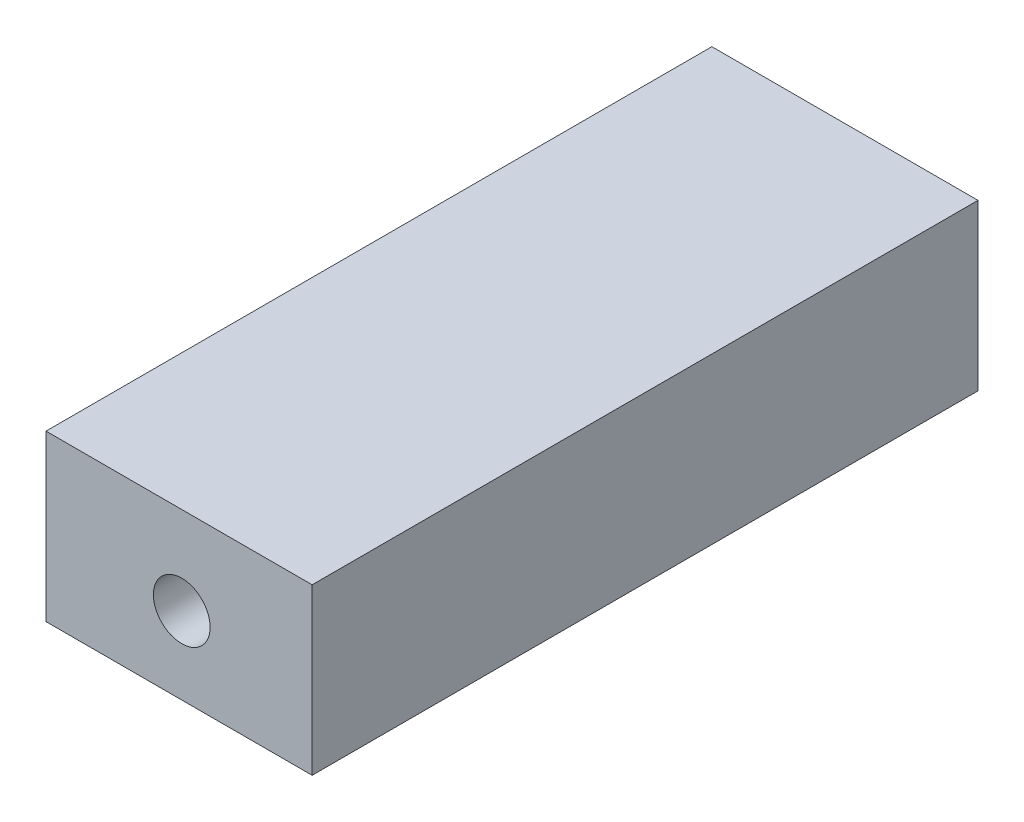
ISO-10303-21;
HEADER;
FILE_DESCRIPTION(('STEP AP214'),'2;1');
FILE_NAME('part.step','',(''),(''),'','','');
FILE_SCHEMA(('AUTOMOTIVE_DESIGN { 1 0 10303 214 1 1 1 1 }'));
ENDSEC;
DATA;
#1=APPLICATION_CONTEXT('core data for automotive mechanical design processes');
#2=APPLICATION_PROTOCOL_DEFINITION('international standard','automotive_design',2000,#1);
#3=PRODUCT_CONTEXT('',#1,'mechanical');
#4=PRODUCT('Part','Part','',(#3));
#5=PRODUCT_RELATED_PRODUCT_CATEGORY('part','',(#4));
#6=PRODUCT_DEFINITION_FORMATION('','',#4);
#7=PRODUCT_DEFINITION_CONTEXT('part definition',#1,'design');
#8=PRODUCT_DEFINITION('design','',#6,#7);
#9=PRODUCT_DEFINITION_SHAPE('','',#8);
#10=(LENGTH_UNIT() NAMED_UNIT(*) SI_UNIT(.MILLI.,.METRE.));
#11=(NAMED_UNIT(*) PLANE_ANGLE_UNIT() SI_UNIT($,.RADIAN.));
#12=(NAMED_UNIT(*) SI_UNIT($,.STERADIAN.) SOLID_ANGLE_UNIT());
#13=UNCERTAINTY_MEASURE_WITH_UNIT(LENGTH_MEASURE(1.E-05),#10,'distance_accuracy_value','');
#14=(GEOMETRIC_REPRESENTATION_CONTEXT(3) GLOBAL_UNCERTAINTY_ASSIGNED_CONTEXT((#13)) GLOBAL_UNIT_ASSIGNED_CONTEXT((#10,
#11,#12)) REPRESENTATION_CONTEXT('',''));
#15=CARTESIAN_POINT('',(0.,0.,0.));
#16=DIRECTION('',(0.,0.,1.));
#17=DIRECTION('',(1.,0.,0.));
#18=AXIS2_PLACEMENT_3D('',#15,#16,#17);
#19=CARTESIAN_POINT('',(0.,0.,31.75));
#20=DIRECTION('',(1.,0.,0.));
#21=DIRECTION('',(0.,0.,-1.));
#22=AXIS2_PLACEMENT_3D('',#19,#20,#21);
#23=PLANE('',#22);
#24=DIRECTION('',(0.,-1.,0.));
#25=VECTOR('',#24,1.);
#26=CARTESIAN_POINT('',(0.,0.,0.));
#27=LINE('',#26,#25);
#28=CARTESIAN_POINT('',(0.,7.86813937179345,0.));
#29=VERTEX_POINT('',#28);
#30=CARTESIAN_POINT('',(0.,0.,0.));
#31=VERTEX_POINT('',#30);
#32=EDGE_CURVE('E93',#29,#31,#27,.T.);
#33=ORIENTED_EDGE('',*,*,#32,.T.);
#34=DIRECTION('',(0.,0.,-1.));
#35=VECTOR('',#34,1.);
#36=CARTESIAN_POINT('',(0.,0.,31.75));
#37=LINE('',#36,#35);
#38=CARTESIAN_POINT('',(0.,0.,31.75));
#39=VERTEX_POINT('',#38);
#40=EDGE_CURVE('E11',#39,#31,#37,.T.);
#41=ORIENTED_EDGE('',*,*,#40,.F.);
#42=DIRECTION('',(0.,-1.,0.));
#43=VECTOR('',#42,1.);
#44=CARTESIAN_POINT('',(0.,0.,31.75));
#45=LINE('',#44,#43);
#46=CARTESIAN_POINT('',(0.,7.86813937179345,31.75));
#47=VERTEX_POINT('',#46);
#48=EDGE_CURVE('E96',#47,#39,#45,.T.);
#49=ORIENTED_EDGE('',*,*,#48,.F.);
#50=DIRECTION('',(0.,0.,-1.));
#51=VECTOR('',#50,1.);
#52=CARTESIAN_POINT('',(0.,7.86813937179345,31.75));
#53=LINE('',#52,#51);
#54=EDGE_CURVE('E102',#47,#29,#53,.T.);
#55=ORIENTED_EDGE('',*,*,#54,.T.);
#56=EDGE_LOOP('',(#33,#41,#49,#55));
#57=FACE_BOUND('',#56,.T.);
#58=ADVANCED_FACE('F30',(#57),#23,.F.);
#59=CARTESIAN_POINT('',(0.,0.,31.75));
#60=DIRECTION('',(0.,1.,0.));
#61=DIRECTION('',(0.,0.,1.));
#62=AXIS2_PLACEMENT_3D('',#59,#60,#61);
#63=PLANE('',#62);
#64=DIRECTION('',(1.,0.,0.));
#65=VECTOR('',#64,1.);
#66=CARTESIAN_POINT('',(0.,0.,0.));
#67=LINE('',#66,#65);
#68=CARTESIAN_POINT('',(12.6905473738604,0.,0.));
#69=VERTEX_POINT('',#68);
#70=EDGE_CURVE('E105',#31,#69,#67,.T.);
#71=ORIENTED_EDGE('',*,*,#70,.T.);
#72=DIRECTION('',(0.,0.,-1.));
#73=VECTOR('',#72,1.);
#74=CARTESIAN_POINT('',(12.6905473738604,0.,31.75));
#75=LINE('',#74,#73);
#76=CARTESIAN_POINT('',(12.6905473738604,0.,31.75));
#77=VERTEX_POINT('',#76);
#78=EDGE_CURVE('E38',#77,#69,#75,.T.);
#79=ORIENTED_EDGE('',*,*,#78,.F.);
#80=DIRECTION('',(1.,0.,0.));
#81=VECTOR('',#80,1.);
#82=CARTESIAN_POINT('',(0.,0.,31.75));
#83=LINE('',#82,#81);
#84=EDGE_CURVE('E77',#39,#77,#83,.T.);
#85=ORIENTED_EDGE('',*,*,#84,.F.);
#86=ORIENTED_EDGE('',*,*,#40,.T.);
#87=EDGE_LOOP('',(#71,#79,#85,#86));
#88=FACE_BOUND('',#87,.T.);
#89=ADVANCED_FACE('F129',(#88),#63,.F.);
#90=CARTESIAN_POINT('',(12.6905473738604,0.,31.75));
#91=DIRECTION('',(-1.,0.,0.));
#92=DIRECTION('',(0.,0.,1.));
#93=AXIS2_PLACEMENT_3D('',#90,#91,#92);
#94=PLANE('',#93);
#95=DIRECTION('',(0.,1.,0.));
#96=VECTOR('',#95,1.);
#97=CARTESIAN_POINT('',(12.6905473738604,0.,0.));
#98=LINE('',#97,#96);
#99=CARTESIAN_POINT('',(12.6905473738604,7.86813937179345,0.));
#100=VERTEX_POINT('',#99);
#101=EDGE_CURVE('E64',#69,#100,#98,.T.);
#102=ORIENTED_EDGE('',*,*,#101,.T.);
#103=DIRECTION('',(0.,0.,-1.));
#104=VECTOR('',#103,1.);
#105=CARTESIAN_POINT('',(12.6905473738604,7.86813937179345,31.75));
#106=LINE('',#105,#104);
#107=CARTESIAN_POINT('',(12.6905473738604,7.86813937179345,31.75));
#108=VERTEX_POINT('',#107);
#109=EDGE_CURVE('E110',#108,#100,#106,.T.);
#110=ORIENTED_EDGE('',*,*,#109,.F.);
#111=DIRECTION('',(0.,1.,0.));
#112=VECTOR('',#111,1.);
#113=CARTESIAN_POINT('',(12.6905473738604,0.,31.75));
#114=LINE('',#113,#112);
#115=EDGE_CURVE('E99',#77,#108,#114,.T.);
#116=ORIENTED_EDGE('',*,*,#115,.F.);
#117=ORIENTED_EDGE('',*,*,#78,.T.);
#118=EDGE_LOOP('',(#102,#110,#116,#117));
#119=FACE_BOUND('',#118,.T.);
#120=ADVANCED_FACE('F112',(#119),#94,.F.);
#121=CARTESIAN_POINT('',(0.,7.86813937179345,31.75));
#122=DIRECTION('',(0.,-1.,0.));
#123=DIRECTION('',(0.,0.,-1.));
#124=AXIS2_PLACEMENT_3D('',#121,#122,#123);
#125=PLANE('',#124);
#126=DIRECTION('',(-1.,0.,0.));
#127=VECTOR('',#126,1.);
#128=CARTESIAN_POINT('',(0.,7.86813937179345,0.));
#129=LINE('',#128,#127);
#130=EDGE_CURVE('E70',#100,#29,#129,.T.);
#131=ORIENTED_EDGE('',*,*,#130,.T.);
#132=ORIENTED_EDGE('',*,*,#54,.F.);
#133=DIRECTION('',(-1.,0.,0.));
#134=VECTOR('',#133,1.);
#135=CARTESIAN_POINT('',(0.,7.86813937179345,31.75));
#136=LINE('',#135,#134);
#137=EDGE_CURVE('E46',#108,#47,#136,.T.);
#138=ORIENTED_EDGE('',*,*,#137,.F.);
#139=ORIENTED_EDGE('',*,*,#109,.T.);
#140=EDGE_LOOP('',(#131,#132,#138,#139));
#141=FACE_BOUND('',#140,.T.);
#142=ADVANCED_FACE('F119',(#141),#125,.F.);
#143=CARTESIAN_POINT('',(0.,7.86813937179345,31.75));
#144=DIRECTION('',(0.,0.,-1.));
#145=DIRECTION('',(-1.,0.,0.));
#146=AXIS2_PLACEMENT_3D('',#143,#144,#145);
#147=PLANE('',#146);
#148=CARTESIAN_POINT('',(6.47306078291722,3.67982369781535,31.75));
#149=DIRECTION('',(0.,0.,1.));
#150=DIRECTION('',(1.,0.,0.));
#151=AXIS2_PLACEMENT_3D('',#148,#149,#150);
#152=CIRCLE('',#151,1.35255);
#153=CARTESIAN_POINT('',(7.82561078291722,3.67982369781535,31.75));
#154=VERTEX_POINT('',#153);
#155=EDGE_CURVE('E90',#154,#154,#152,.T.);
#156=ORIENTED_EDGE('',*,*,#155,.F.);
#157=EDGE_LOOP('',(#156));
#158=FACE_BOUND('',#157,.T.);
#159=ORIENTED_EDGE('',*,*,#48,.T.);
#160=ORIENTED_EDGE('',*,*,#84,.T.);
#161=ORIENTED_EDGE('',*,*,#115,.T.);
#162=ORIENTED_EDGE('',*,*,#137,.T.);
#163=EDGE_LOOP('',(#159,#160,#161,#162));
#164=FACE_BOUND('',#163,.T.);
#165=ADVANCED_FACE('F121',(#158,#164),#147,.F.);
#166=CARTESIAN_POINT('',(0.,7.86813937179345,0.));
#167=DIRECTION('',(0.,0.,-1.));
#168=DIRECTION('',(-1.,0.,0.));
#169=AXIS2_PLACEMENT_3D('',#166,#167,#168);
#170=PLANE('',#169);
#171=ORIENTED_EDGE('',*,*,#32,.F.);
#172=ORIENTED_EDGE('',*,*,#130,.F.);
#173=ORIENTED_EDGE('',*,*,#101,.F.);
#174=ORIENTED_EDGE('',*,*,#70,.F.);
#175=EDGE_LOOP('',(#171,#172,#173,#174));
#176=FACE_BOUND('',#175,.T.);
#177=ADVANCED_FACE('F115',(#176),#170,.T.);
#178=CARTESIAN_POINT('',(6.47306078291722,3.67982369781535,31.75));
#179=DIRECTION('',(0.,0.,1.));
#180=DIRECTION('',(1.,0.,0.));
#181=AXIS2_PLACEMENT_3D('',#178,#179,#180);
#182=CYLINDRICAL_SURFACE('',#181,1.35255);
#183=CARTESIAN_POINT('',(6.47306078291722,3.67982369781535,21.59));
#184=DIRECTION('',(0.,0.,1.));
#185=DIRECTION('',(1.,0.,0.));
#186=AXIS2_PLACEMENT_3D('',#183,#184,#185);
#187=CIRCLE('',#186,1.35255);
#188=CARTESIAN_POINT('',(7.82561078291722,3.67982369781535,21.59));
#189=VERTEX_POINT('',#188);
#190=EDGE_CURVE('E88',#189,#189,#187,.T.);
#191=ORIENTED_EDGE('',*,*,#190,.F.);
#192=EDGE_LOOP('',(#191));
#193=FACE_BOUND('',#192,.T.);
#194=ORIENTED_EDGE('',*,*,#155,.T.);
#195=EDGE_LOOP('',(#194));
#196=FACE_BOUND('',#195,.T.);
#197=ADVANCED_FACE('F84',(#193,#196),#182,.F.);
#198=CARTESIAN_POINT('',(6.47306078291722,3.67982369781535,21.59));
#199=DIRECTION('',(0.,0.,1.));
#200=DIRECTION('',(1.,0.,0.));
#201=AXIS2_PLACEMENT_3D('',#198,#199,#200);
#202=CONICAL_SURFACE('',#201,1.35255,1.02974425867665);
#203=CARTESIAN_POINT('',(6.47306078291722,3.67982369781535,20.7773059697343));
#204=VERTEX_POINT('',#203);
#205=VERTEX_LOOP('',#204);
#206=FACE_BOUND('',#205,.T.);
#207=ORIENTED_EDGE('',*,*,#190,.T.);
#208=EDGE_LOOP('',(#207));
#209=FACE_BOUND('',#208,.T.);
#210=ADVANCED_FACE('F81',(#206,#209),#202,.F.);
#211=CLOSED_SHELL('',(#58,#89,#120,#142,#165,#177,#197,#210));
#212=MANIFOLD_SOLID_BREP('B2',#211);
#213=ADVANCED_BREP_SHAPE_REPRESENTATION('',(#18,#212),#14);
#214=SHAPE_DEFINITION_REPRESENTATION(#9,#213);
ENDSEC;
END-ISO-10303-21;
